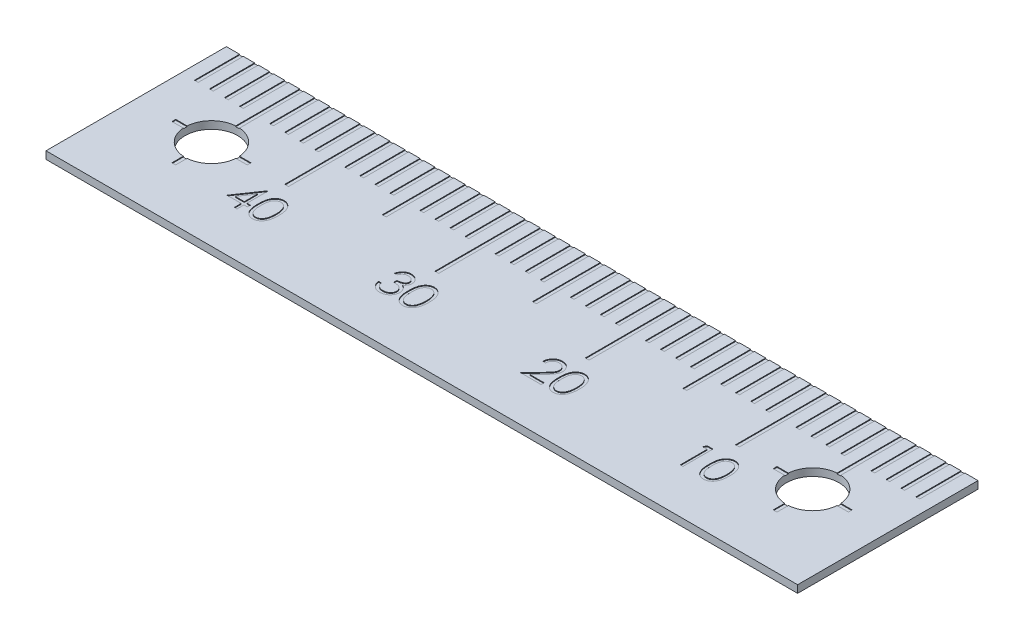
from build123d import *

# Parameters (mm, degrees)
SKETCH1_W           = 50
SKETCH1_H           = 12
BOSS_EXTRUDE1_DEPTH = 0.5
SKETCH2_W           = 0.25
SKETCH2_H           = 3
CUT_EXTRUDE2_DEPTH  = 0.05
LPATTERN2_COUNT     = 49
LPATTERN2_PITCH     = 1
SKETCH3_W           = 0.25
SKETCH3_H           = 3
CUT_EXTRUDE3_DEPTH  = 0.05
LPATTERN3_COUNT     = 4
LPATTERN3_PITCH     = 10
SKETCH4_W           = 0.25
SKETCH4_H           = 1.5
CUT_EXTRUDE4_DEPTH  = 0.05
LPATTERN4_COUNT     = 4
LPATTERN4_PITCH     = 10
LPATTERN4_COL_COUNT = 2
LPATTERN4_COL_PITCH = 10
CUT_EXTRUDE6_DEPTH  = 0.05
LPATTERN5_COUNT     = 2
LPATTERN5_PITCH     = 40
CUT_EXTRUDE12_DEPTH = 0.05
SKETCH20_R          = 1.75
CUT_EXTRUDE15_DEPTH = 0.5
LPATTERN6_COUNT     = 2
LPATTERN6_PITCH     = 40


with BuildPart() as part:
    # Sketch1 → Boss-Extrude1 (new body)
    with BuildSketch(Plane(origin=(0, 0, 0), x_dir=(1, 0, 0), z_dir=(0, 1, 0))):
        Rectangle(SKETCH1_W, SKETCH1_H)
    extrude(amount=-BOSS_EXTRUDE1_DEPTH)

    # Sketch2 → Cut-Extrude2 (cut)
    with BuildSketch(Plane(origin=(0, 0, 0), x_dir=(1, 0, 0), z_dir=(0, 1, 0))):
        with Locations((-24, 4.5)):
            Rectangle(SKETCH2_W, SKETCH2_H)
    cut_extrude2 = extrude(amount=-CUT_EXTRUDE2_DEPTH, mode=Mode.SUBTRACT)

    # LPattern2: Cut-Extrude2 ×49
    with Locations(*[(i * LPATTERN2_PITCH, 0, 0) for i in range(1, LPATTERN2_COUNT)]):
        add(cut_extrude2, mode=Mode.SUBTRACT)

    # Sketch3 → Cut-Extrude3 (cut)
    with BuildSketch(Plane(origin=(0, 0, 0), x_dir=(1, 0, 0), z_dir=(0, 1, 0))):
        with Locations((-15, 1.5)):
            Rectangle(SKETCH3_W, SKETCH3_H)
    cut_extrude3 = extrude(amount=-CUT_EXTRUDE3_DEPTH, mode=Mode.SUBTRACT)

    # LPattern3: Cut-Extrude3 ×4
    with Locations(*[(i * LPATTERN3_PITCH, 0, 0) for i in range(1, LPATTERN3_COUNT)]):
        add(cut_extrude3, mode=Mode.SUBTRACT)

    # Sketch4 → Cut-Extrude4 (cut)
    with BuildSketch(Plane(origin=(0, 0, 0), x_dir=(1, 0, 0), z_dir=(0, 1, 0))):
        with Locations((-10, 2.25)):
            Rectangle(SKETCH4_W, SKETCH4_H)
    cut_extrude4 = extrude(amount=-CUT_EXTRUDE4_DEPTH, mode=Mode.SUBTRACT)

    # LPattern4: Cut-Extrude4 ×4
    with Locations(*[(i * LPATTERN4_PITCH, 0, 0) for i in range(1, LPATTERN4_COUNT)]):
        add(cut_extrude4, mode=Mode.SUBTRACT)

    # LPattern4 col: Cut-Extrude4 ×2
    with Locations(*[(-i * LPATTERN4_COL_PITCH, 0, 0) for i in range(1, LPATTERN4_COL_COUNT)]):
        add(cut_extrude4, mode=Mode.SUBTRACT)

    # Sketch5 → Cut-Extrude6 (cut)
    with BuildSketch(Plane(origin=(0, 0, 0), x_dir=(1, 0, 0), z_dir=(0, 1, 0))):
        with BuildLine():
            Line((-20.12, 2.5), (-19.87, 2.5))
            Line((-19.87, 2.5), (-19.87, 1.74553))
            ThreePointArc((-19.87, 1.74553), (-18.757563, 1.237437), (-18.24947, 0.125))
            Line((-18.24947, 0.125), (-17.495, 0.125))
            Line((-17.495, 0.125), (-17.495, -0.125))
            Line((-17.495, -0.125), (-18.24947, -0.125))
            ThreePointArc((-18.24947, -0.125), (-18.757563, -1.237437), (-19.87, -1.74553))
            Line((-19.87, -1.74553), (-19.87, -2.5))
            Line((-19.87, -2.5), (-20.12, -2.5))
            Line((-20.12, -2.5), (-20.12, -1.74553))
            ThreePointArc((-20.12, -1.74553), (-21.232437, -1.237437), (-21.74053, -0.125))
            Line((-21.74053, -0.125), (-22.495, -0.125))
            Line((-22.495, -0.125), (-22.495, 0.125))
            Line((-22.495, 0.125), (-21.74053, 0.125))
            ThreePointArc((-21.74053, 0.125), (-21.232437, 1.237437), (-20.12, 1.74553))
            Line((-20.12, 1.74553), (-20.12, 2.5))
        make_face()
        with BuildLine():
            Line((-20.12, 1.494783), (-20.12, 0.125))
            Line((-20.12, 0.125), (-21.489783, 0.125))
            ThreePointArc((-21.489783, 0.125), (-21.05566, 1.06066), (-20.12, 1.494783))
        make_face(mode=Mode.SUBTRACT)
        with BuildLine():
            Line((-19.87, 1.494783), (-19.87, 0.125))
            Line((-19.87, 0.125), (-18.500217, 0.125))
            ThreePointArc((-18.500217, 0.125), (-18.93434, 1.06066), (-19.87, 1.494783))
        make_face(mode=Mode.SUBTRACT)
        with BuildLine():
            Line((-21.489783, -0.125), (-20.12, -0.125))
            Line((-20.12, -0.125), (-20.12, -1.494783))
            ThreePointArc((-20.12, -1.494783), (-21.05566, -1.06066), (-21.489783, -0.125))
        make_face(mode=Mode.SUBTRACT)
        with BuildLine():
            Line((-19.87, -0.125), (-19.87, -1.494783))
            ThreePointArc((-19.87, -1.494783), (-18.93434, -1.06066), (-18.500217, -0.125))
            Line((-18.500217, -0.125), (-19.87, -0.125))
        make_face(mode=Mode.SUBTRACT)
    cut_extrude6 = extrude(amount=-CUT_EXTRUDE6_DEPTH, mode=Mode.SUBTRACT)

    # LPattern5: Cut-Extrude6 ×2
    with Locations(*[(i * LPATTERN5_PITCH, 0, 0) for i in range(1, LPATTERN5_COUNT)]):
        add(cut_extrude6, mode=Mode.SUBTRACT)

    # Sketch15 → Cut-Extrude12 (cut)
    # profile 1 of 8: a face of its own
    with BuildSketch(Plane(origin=(0, 0, 0), x_dir=(1, 0, 0), z_dir=(0, 1, 0))):
        Polygon((-15.33133, -0.948718), (-15.294872, -0.948718), (-15.294872, -2.333333), (-15.064103, -2.333333), (-15.064103, -2.538462), (-15.294872, -2.538462), (-15.294872, -3), (-15.474359, -3), (-15.474359, -2.538462), (-16.423077, -2.538462), align=None)
        Polygon((-15.474359, -2.333333), (-15.474359, -1.464744), (-16.070513, -2.333333), align=None, mode=Mode.SUBTRACT)
    # profile 2 of 8: a face of its own
    with BuildSketch(Plane(origin=(0, 0, 0), x_dir=(1, 0, 0), z_dir=(0, 1, 0))):
        with BuildLine():
            add(Edge.make_bspline(
                [(-14.884615, -2.000801), (-14.884428, -1.968746), (-14.884064, -1.906477), (-14.880013, -1.815743), (-14.873285, -1.730623), (-14.864063, -1.651112), (-14.852841, -1.577191), (-14.837861, -1.509057), (-14.820825, -1.446395), (-14.801081, -1.388999), (-14.778802, -1.336098), (-14.754554, -1.286712), (-14.727374, -1.240916), (-14.698816, -1.197981), (-14.667723, -1.158607), (-14.634981, -1.12224), (-14.599312, -1.089719), (-14.561927, -1.060093), (-14.522489, -1.034122), (-14.482122, -1.011246), (-14.440548, -0.991703), (-14.397653, -0.976337), (-14.353823, -0.963645), (-14.308904, -0.954966), (-14.262823, -0.949505), (-14.23172, -0.948983), (-14.215946, -0.948718)],
                knots=[0, 0, 0, 0, 1.646271, 3.197905, 4.663502, 6.030701, 7.308323, 8.501638, 9.611534, 10.641858, 11.616357, 12.558055, 13.465017, 14.349606, 15.204444, 16.039544, 16.859896, 17.680448, 18.487036, 19.282494, 20.061911, 20.843046, 21.620317, 22.403197, 23.190182, 24, 24, 24, 24], degree=3))
            add(Edge.make_bspline(
                [(-14.215946, -0.948718), (-14.20004, -0.948997), (-14.168408, -0.949551), (-14.121642, -0.954879), (-14.075956, -0.96372), (-14.031546, -0.976246), (-13.988046, -0.991786), (-13.945796, -1.011265), (-13.904535, -1.033938), (-13.864918, -1.060581), (-13.826509, -1.090285), (-13.790253, -1.123863), (-13.756147, -1.160977), (-13.723761, -1.20123), (-13.694015, -1.245393), (-13.665687, -1.292698), (-13.640332, -1.343973), (-13.615912, -1.398362), (-13.594833, -1.45737), (-13.575824, -1.520664), (-13.560465, -1.588992), (-13.547671, -1.661995), (-13.537759, -1.739942), (-13.530541, -1.822666), (-13.526728, -1.910221), (-13.52601, -1.970082), (-13.525641, -2.000801)],
                knots=[0, 0, 0, 0, 0.810915, 1.612654, 2.396698, 3.181599, 3.963628, 4.749916, 5.551656, 6.361999, 7.182127, 8.025566, 8.878628, 9.750805, 10.657532, 11.591945, 12.560507, 13.572878, 14.63071, 15.753379, 16.941252, 18.199788, 19.531963, 20.947069, 22.433334, 24, 24, 24, 24], degree=3))
            add(Edge.make_bspline(
                [(-13.525641, -2.000801), (-13.526013, -2.031386), (-13.526739, -2.09098), (-13.530498, -2.178141), (-13.537903, -2.260425), (-13.547166, -2.338031), (-13.559995, -2.410636), (-13.575769, -2.47849), (-13.593284, -2.541886), (-13.614904, -2.600306), (-13.638567, -2.654564), (-13.664313, -2.705231), (-13.691896, -2.752755), (-13.721946, -2.796755), (-13.753977, -2.837542), (-13.788673, -2.874398), (-13.825056, -2.90821), (-13.863577, -2.938297), (-13.903812, -2.964631), (-13.944932, -2.988182), (-13.987665, -3.007172), (-14.031044, -3.023477), (-14.075689, -3.035935), (-14.121544, -3.044549), (-14.168376, -3.05059), (-14.200034, -3.05105), (-14.215946, -3.051282)],
                knots=[0, 0, 0, 0, 1.561519, 3.042556, 4.452378, 5.778352, 7.031515, 8.214009, 9.334063, 10.386616, 11.391082, 12.354593, 13.286541, 14.194234, 15.072675, 15.931287, 16.775624, 17.606196, 18.423083, 19.229, 20.022332, 20.807537, 21.593274, 22.384846, 23.188221, 24, 24, 24, 24], degree=3))
            add(Edge.make_bspline(
                [(-14.215946, -3.051282), (-14.231719, -3.051016), (-14.262822, -3.05049), (-14.308909, -3.045054), (-14.353642, -3.036313), (-14.397241, -3.024075), (-14.439931, -3.009095), (-14.481129, -2.989579), (-14.521293, -2.967102), (-14.560317, -2.941505), (-14.597467, -2.912178), (-14.632951, -2.879742), (-14.66588, -2.843385), (-14.696528, -2.803684), (-14.725656, -2.761002), (-14.75245, -2.714757), (-14.777233, -2.665133), (-14.799887, -2.611808), (-14.819972, -2.554005), (-14.837713, -2.491063), (-14.851721, -2.422426), (-14.863712, -2.348644), (-14.873383, -2.269402), (-14.879985, -2.184656), (-14.884066, -2.094458), (-14.884429, -2.03259), (-14.884615, -2.000801)],
                knots=[0, 0, 0, 0, 0.810892, 1.59892, 2.382837, 3.152668, 3.926045, 4.706494, 5.493654, 6.291793, 7.103789, 7.925228, 8.761436, 9.622818, 10.502889, 11.416981, 12.369137, 13.353925, 14.394356, 15.51418, 16.714355, 17.994756, 19.357759, 20.818453, 22.365282, 24, 24, 24, 24], degree=3))
        make_face()
        with BuildLine():
            add(Edge.make_bspline(
                [(-14.705128, -2), (-14.70506, -2.026714), (-14.704927, -2.078559), (-14.701467, -2.153898), (-14.696752, -2.224167), (-14.690672, -2.289455), (-14.681641, -2.349541), (-14.671523, -2.404837), (-14.65921, -2.455053), (-14.644641, -2.500532), (-14.628048, -2.542046), (-14.60993, -2.580675), (-14.590467, -2.616876), (-14.568684, -2.650324), (-14.544961, -2.681127), (-14.519834, -2.709832), (-14.492364, -2.73543), (-14.454362, -2.766131), (-14.404192, -2.797856), (-14.340981, -2.825483), (-14.276027, -2.842844), (-14.231941, -2.845052), (-14.209936, -2.846154)],
                knots=[0, 0, 0, 0, 1.459021, 2.831674, 4.118529, 5.306027, 6.411945, 7.43633, 8.375795, 9.233975, 10.042672, 10.816086, 11.563611, 12.285937, 12.993565, 13.685989, 14.367179, 15.041617, 16.353049, 17.594442, 18.799311, 20, 20, 20, 20], degree=3))
            add(Edge.make_bspline(
                [(-14.209936, -2.846154), (-14.187789, -2.845241), (-14.14354, -2.843417), (-14.078892, -2.825817), (-14.016132, -2.799263), (-13.966948, -2.767865), (-13.929529, -2.737963), (-13.90272, -2.712469), (-13.878113, -2.683923), (-13.854774, -2.653123), (-13.833369, -2.619482), (-13.813905, -2.58316), (-13.796143, -2.544058), (-13.786023, -2.516761), (-13.780849, -2.502804)],
                knots=[0, 0, 0, 0, 1.353761, 2.704727, 4.075138, 5.516105, 6.260822, 7.00711, 7.77809, 8.566572, 9.372053, 10.217411, 11.088608, 12, 12, 12, 12], degree=3))
            add(Edge.make_bspline(
                [(-13.780849, -2.502804), (-13.77482, -2.484959), (-13.762577, -2.448725), (-13.746799, -2.392517), (-13.734373, -2.333544), (-13.723194, -2.272158), (-13.715564, -2.207907), (-13.709422, -2.140989), (-13.705805, -2.071354), (-13.705356, -2.024043), (-13.705128, -2)],
                knots=[0, 0, 0, 0, 0.884707, 1.796334, 2.740028, 3.714593, 4.726048, 5.77782, 6.870743, 8, 8, 8, 8], degree=3))
            add(Edge.make_bspline(
                [(-13.705128, -2), (-13.705443, -1.975961), (-13.706058, -1.928937), (-13.708408, -1.860069), (-13.714479, -1.794659), (-13.721221, -1.732424), (-13.731163, -1.67371), (-13.741881, -1.618024), (-13.756282, -1.566057), (-13.771665, -1.516994), (-13.789271, -1.471394), (-13.808651, -1.429043), (-13.829349, -1.389737), (-13.851831, -1.353585), (-13.875828, -1.320423), (-13.901975, -1.290918), (-13.929235, -1.264154), (-13.967416, -1.233604), (-14.017402, -1.202454), (-14.079599, -1.173788), (-14.144325, -1.157326), (-14.188081, -1.155005), (-14.209936, -1.153846)],
                knots=[0, 0, 0, 0, 1.313624, 2.569729, 3.763503, 4.902123, 5.988968, 7.016459, 7.998834, 8.933435, 9.825091, 10.667527, 11.477055, 12.250526, 12.991943, 13.710641, 14.402116, 15.076753, 16.378508, 17.609869, 18.806227, 20, 20, 20, 20], degree=3))
            add(Edge.make_bspline(
                [(-14.209936, -1.153846), (-14.232056, -1.155007), (-14.276337, -1.157331), (-14.341736, -1.173727), (-14.404424, -1.202306), (-14.454277, -1.233707), (-14.492485, -1.263615), (-14.51939, -1.28955), (-14.544616, -1.317919), (-14.567855, -1.349006), (-14.58962, -1.382415), (-14.609609, -1.418408), (-14.627619, -1.457169), (-14.644239, -1.498664), (-14.658852, -1.544139), (-14.670906, -1.594293), (-14.682041, -1.649414), (-14.689924, -1.709825), (-14.696932, -1.775129), (-14.701435, -1.845573), (-14.704939, -1.921039), (-14.705064, -1.973152), (-14.705128, -2)],
                knots=[0, 0, 0, 0, 1.207732, 2.417665, 3.655092, 4.956221, 5.625982, 6.301752, 6.994048, 7.697132, 8.419324, 9.170224, 9.943494, 10.752041, 11.61006, 12.549351, 13.567764, 14.679664, 15.874934, 17.154273, 18.533957, 20, 20, 20, 20], degree=3))
        make_face(mode=Mode.SUBTRACT)
    # profile 3 of 8: a face of its own
    with BuildSketch(Plane(origin=(0, 0, 0), x_dir=(1, 0, 0), z_dir=(0, 1, 0))):
        with BuildLine():
            Line((-6.166667, -1.461538), (-6.346154, -1.461538))
            add(Edge.make_bspline(
                [(-6.346154, -1.461538), (-6.341291, -1.441406), (-6.331785, -1.402048), (-6.311958, -1.345815), (-6.290359, -1.292601), (-6.264422, -1.243404), (-6.236131, -1.197233), (-6.203718, -1.155136), (-6.168678, -1.116043), (-6.129921, -1.08135), (-6.089276, -1.049934), (-6.046171, -1.023148), (-6.001472, -1.000106), (-5.95487, -0.981123), (-5.906227, -0.966823), (-5.855981, -0.956447), (-5.804002, -0.949709), (-5.768718, -0.949052), (-5.750801, -0.948718)],
                knots=[0, 0, 0, 0, 1.162006, 2.271626, 3.343759, 4.38331, 5.39023, 6.379919, 7.361854, 8.333199, 9.295911, 10.242431, 11.177959, 12.116337, 13.062827, 14.020065, 14.994645, 16, 16, 16, 16], degree=3))
            add(Edge.make_bspline(
                [(-5.750801, -0.948718), (-5.724697, -0.949506), (-5.673057, -0.951065), (-5.597193, -0.965302), (-5.524035, -0.987831), (-5.454384, -1.018958), (-5.389687, -1.057351), (-5.332124, -1.103045), (-5.282473, -1.155159), (-5.240819, -1.212721), (-5.208205, -1.274238), (-5.184156, -1.337553), (-5.169515, -1.402514), (-5.167617, -1.446375), (-5.166667, -1.468349)],
                knots=[0, 0, 0, 0, 1.083051, 2.142477, 3.193116, 4.255572, 5.302634, 6.308963, 7.297364, 8.282367, 9.249858, 10.179914, 11.088141, 12, 12, 12, 12], degree=3))
            add(Edge.make_bspline(
                [(-5.166667, -1.468349), (-5.167332, -1.489496), (-5.168633, -1.530877), (-5.179681, -1.591289), (-5.198273, -1.648227), (-5.224027, -1.701931), (-5.257365, -1.752059), (-5.297749, -1.798726), (-5.345465, -1.842137), (-5.381624, -1.867005), (-5.40024, -1.879808)],
                knots=[0, 0, 0, 0, 1.02454, 2.004867, 2.965041, 3.920578, 4.882998, 5.874505, 6.905732, 8, 8, 8, 8], degree=3))
            add(Edge.make_bspline(
                [(-5.40024, -1.879808), (-5.378965, -1.890081), (-5.336813, -1.910435), (-5.279355, -1.950353), (-5.227196, -1.996442), (-5.198109, -2.032409), (-5.183494, -2.050481)],
                knots=[0, 0, 0, 0, 1.015518, 2.012036, 3.001164, 4, 4, 4, 4], degree=3))
            add(Edge.make_bspline(
                [(-5.183494, -2.050481), (-5.17387, -2.063657), (-5.15478, -2.089793), (-5.131217, -2.131813), (-5.109841, -2.1743), (-5.093183, -2.218391), (-5.080284, -2.263576), (-5.071063, -2.309931), (-5.065335, -2.357496), (-5.064515, -2.389674), (-5.064103, -2.405849)],
                knots=[0, 0, 0, 0, 1.025084, 2.033382, 3.024893, 4.013698, 4.99189, 5.976765, 6.982997, 8, 8, 8, 8], degree=3))
            add(Edge.make_bspline(
                [(-5.064103, -2.405849), (-5.065128, -2.433855), (-5.067174, -2.489734), (-5.085462, -2.572291), (-5.113813, -2.652992), (-5.154074, -2.730177), (-5.203141, -2.802394), (-5.261516, -2.86701), (-5.328537, -2.922552), (-5.403283, -2.968957), (-5.484264, -3.006053), (-5.570879, -3.0318), (-5.661879, -3.04857), (-5.724283, -3.050368), (-5.75601, -3.051282)],
                knots=[0, 0, 0, 0, 0.955779, 1.90706, 2.875434, 3.871313, 4.872416, 5.851225, 6.836216, 7.836434, 8.849229, 9.869734, 10.916972, 12, 12, 12, 12], degree=3))
            add(Edge.make_bspline(
                [(-5.75601, -3.051282), (-5.777392, -3.050786), (-5.819466, -3.04981), (-5.881319, -3.043136), (-5.94036, -3.030948), (-5.996668, -3.014546), (-6.050294, -2.99375), (-6.101074, -2.967854), (-6.149319, -2.93739), (-6.194576, -2.902), (-6.236838, -2.86241), (-6.274982, -2.81792), (-6.309645, -2.76935), (-6.339898, -2.716136), (-6.367119, -2.658968), (-6.389508, -2.597111), (-6.409214, -2.531121), (-6.418376, -2.485133), (-6.423077, -2.461538)],
                knots=[0, 0, 0, 0, 1.048659, 2.063411, 3.046034, 4.001478, 4.936775, 5.862367, 6.792675, 7.73072, 8.675894, 9.62783, 10.600096, 11.597688, 12.626045, 13.701542, 14.820724, 16, 16, 16, 16], degree=3))
            Line((-6.423077, -2.461538), (-6.24359, -2.461538))
            add(Edge.make_bspline(
                [(-6.24359, -2.461538), (-6.238914, -2.476938), (-6.229818, -2.506891), (-6.214336, -2.55), (-6.196697, -2.589519), (-6.177774, -2.625738), (-6.157901, -2.659013), (-6.135663, -2.688466), (-6.11271, -2.715389), (-6.095407, -2.730557), (-6.086939, -2.737981)],
                knots=[0, 0, 0, 0, 1.198163, 2.330531, 3.407731, 4.417277, 5.372219, 6.288973, 7.162601, 8, 8, 8, 8], degree=3))
            add(Edge.make_bspline(
                [(-6.086939, -2.737981), (-6.075741, -2.746614), (-6.05338, -2.763854), (-6.016941, -2.785855), (-5.978618, -2.804918), (-5.937581, -2.819481), (-5.894715, -2.831811), (-5.849328, -2.83988), (-5.80182, -2.845416), (-5.769381, -2.845904), (-5.752804, -2.846154)],
                knots=[0, 0, 0, 0, 0.94617, 1.88942, 2.845303, 3.807233, 4.801019, 5.828865, 6.890508, 8, 8, 8, 8], degree=3))
            add(Edge.make_bspline(
                [(-5.752804, -2.846154), (-5.734088, -2.845802), (-5.69749, -2.845114), (-5.644087, -2.838785), (-5.593283, -2.829567), (-5.545641, -2.815331), (-5.500538, -2.797742), (-5.458606, -2.775657), (-5.419294, -2.749746), (-5.383106, -2.720295), (-5.350565, -2.688054), (-5.321914, -2.654333), (-5.297557, -2.619272), (-5.277909, -2.582679), (-5.262395, -2.544705), (-5.251833, -2.505242), (-5.244489, -2.464615), (-5.243891, -2.436999), (-5.24359, -2.423077)],
                knots=[0, 0, 0, 0, 1.217148, 2.380027, 3.494445, 4.572153, 5.609568, 6.639425, 7.649109, 8.668171, 9.669598, 10.6252, 11.543418, 12.441394, 13.322311, 14.205496, 15.095365, 16, 16, 16, 16], degree=3))
            add(Edge.make_bspline(
                [(-5.24359, -2.423077), (-5.244464, -2.404442), (-5.246209, -2.367264), (-5.259528, -2.312569), (-5.281436, -2.25987), (-5.312106, -2.210066), (-5.349441, -2.163909), (-5.393078, -2.122725), (-5.44338, -2.088742), (-5.489677, -2.065263), (-5.530685, -2.049242), (-5.56578, -2.03857), (-5.605069, -2.029534), (-5.648079, -2.021127), (-5.695132, -2.013972), (-5.746178, -2.008005), (-5.801227, -2.003231), (-5.839336, -2.001099), (-5.858974, -2)],
                knots=[0, 0, 0, 0, 1.070547, 2.135767, 3.216562, 4.339749, 5.48608, 6.621378, 7.775626, 8.963673, 9.598147, 10.304877, 11.070271, 11.915, 12.823868, 13.805723, 14.869254, 16, 16, 16, 16], degree=3))
            Line((-5.858974, -2), (-5.858974, -1.794872))
            add(Edge.make_bspline(
                [(-5.858974, -1.794872), (-5.834231, -1.794452), (-5.785764, -1.793629), (-5.714968, -1.783682), (-5.647269, -1.769922), (-5.584168, -1.748844), (-5.526654, -1.724364), (-5.476757, -1.695877), (-5.435176, -1.664212), (-5.402112, -1.628879), (-5.377239, -1.590984), (-5.359052, -1.551489), (-5.348309, -1.510047), (-5.346875, -1.481764), (-5.346154, -1.467548)],
                knots=[0, 0, 0, 0, 1.321987, 2.589447, 3.816329, 5.010887, 6.139806, 7.153945, 8.075214, 8.924035, 9.728124, 10.488708, 11.240356, 12, 12, 12, 12], degree=3))
            add(Edge.make_bspline(
                [(-5.346154, -1.467548), (-5.346391, -1.457104), (-5.346862, -1.436325), (-5.352803, -1.405968), (-5.361731, -1.376539), (-5.374005, -1.348163), (-5.390434, -1.321037), (-5.410094, -1.29493), (-5.433505, -1.26999), (-5.460331, -1.246745), (-5.489138, -1.224591), (-5.520709, -1.205783), (-5.554093, -1.1897), (-5.589326, -1.176437), (-5.626524, -1.166461), (-5.66551, -1.159297), (-5.70636, -1.154819), (-5.73423, -1.154174), (-5.748397, -1.153846)],
                knots=[0, 0, 0, 0, 0.884393, 1.759458, 2.611959, 3.489219, 4.372814, 5.294549, 6.255912, 7.266815, 8.301785, 9.332969, 10.376267, 11.440494, 12.520033, 13.637163, 14.798856, 16, 16, 16, 16], degree=3))
            add(Edge.make_bspline(
                [(-5.748397, -1.153846), (-5.77117, -1.154641), (-5.81565, -1.156194), (-5.879772, -1.169796), (-5.939383, -1.191498), (-5.984948, -1.217402), (-6.018596, -1.242974), (-6.04264, -1.265307), (-6.066251, -1.290125), (-6.087877, -1.318959), (-6.109748, -1.349854), (-6.129659, -1.384382), (-6.149008, -1.421642), (-6.160666, -1.447982), (-6.166667, -1.461538)],
                knots=[0, 0, 0, 0, 1.472543, 2.87622, 4.22179, 5.565194, 6.249814, 6.953379, 7.68725, 8.46357, 9.283607, 10.136033, 11.040678, 12, 12, 12, 12], degree=3))
        make_face()
    # profile 4 of 8: a face of its own
    with BuildSketch(Plane(origin=(0, 0, 0), x_dir=(1, 0, 0), z_dir=(0, 1, 0))):
        with BuildLine():
            add(Edge.make_bspline(
                [(-4.884615, -2.000801), (-4.884428, -1.968746), (-4.884064, -1.906477), (-4.880013, -1.815743), (-4.873285, -1.730623), (-4.864063, -1.651112), (-4.852841, -1.577191), (-4.837861, -1.509057), (-4.820825, -1.446395), (-4.801081, -1.388999), (-4.778802, -1.336098), (-4.754554, -1.286712), (-4.727374, -1.240916), (-4.698816, -1.197981), (-4.667723, -1.158607), (-4.634981, -1.12224), (-4.599312, -1.089719), (-4.561927, -1.060093), (-4.522489, -1.034122), (-4.482122, -1.011246), (-4.440548, -0.991703), (-4.397653, -0.976337), (-4.353823, -0.963645), (-4.308904, -0.954966), (-4.262823, -0.949505), (-4.23172, -0.948983), (-4.215946, -0.948718)],
                knots=[0, 0, 0, 0, 1.646271, 3.197905, 4.663502, 6.030701, 7.308323, 8.501638, 9.611534, 10.641858, 11.616357, 12.558055, 13.465017, 14.349606, 15.204444, 16.039544, 16.859896, 17.680448, 18.487036, 19.282494, 20.061911, 20.843046, 21.620317, 22.403197, 23.190182, 24, 24, 24, 24], degree=3))
            add(Edge.make_bspline(
                [(-4.215946, -0.948718), (-4.20004, -0.948997), (-4.168408, -0.949551), (-4.121642, -0.954879), (-4.075956, -0.96372), (-4.031546, -0.976246), (-3.988046, -0.991786), (-3.945796, -1.011265), (-3.904535, -1.033938), (-3.864918, -1.060581), (-3.826509, -1.090285), (-3.790253, -1.123863), (-3.756147, -1.160977), (-3.723761, -1.20123), (-3.694015, -1.245393), (-3.665687, -1.292698), (-3.640332, -1.343973), (-3.615912, -1.398362), (-3.594833, -1.45737), (-3.575824, -1.520664), (-3.560465, -1.588992), (-3.547671, -1.661995), (-3.537759, -1.739942), (-3.530541, -1.822666), (-3.526728, -1.910221), (-3.52601, -1.970082), (-3.525641, -2.000801)],
                knots=[0, 0, 0, 0, 0.810915, 1.612654, 2.396698, 3.181599, 3.963628, 4.749916, 5.551656, 6.361999, 7.182127, 8.025566, 8.878628, 9.750805, 10.657532, 11.591945, 12.560507, 13.572878, 14.63071, 15.753379, 16.941252, 18.199788, 19.531963, 20.947069, 22.433334, 24, 24, 24, 24], degree=3))
            add(Edge.make_bspline(
                [(-3.525641, -2.000801), (-3.526013, -2.031386), (-3.526739, -2.09098), (-3.530498, -2.178141), (-3.537903, -2.260425), (-3.547166, -2.338031), (-3.559995, -2.410636), (-3.575769, -2.47849), (-3.593284, -2.541886), (-3.614904, -2.600306), (-3.638567, -2.654564), (-3.664313, -2.705231), (-3.691896, -2.752755), (-3.721946, -2.796755), (-3.753977, -2.837542), (-3.788673, -2.874398), (-3.825056, -2.90821), (-3.863577, -2.938297), (-3.903812, -2.964631), (-3.944932, -2.988182), (-3.987665, -3.007172), (-4.031044, -3.023477), (-4.075689, -3.035935), (-4.121544, -3.044549), (-4.168376, -3.05059), (-4.200034, -3.05105), (-4.215946, -3.051282)],
                knots=[0, 0, 0, 0, 1.561519, 3.042556, 4.452378, 5.778352, 7.031515, 8.214009, 9.334063, 10.386616, 11.391082, 12.354593, 13.286541, 14.194234, 15.072675, 15.931287, 16.775624, 17.606196, 18.423083, 19.229, 20.022332, 20.807537, 21.593274, 22.384846, 23.188221, 24, 24, 24, 24], degree=3))
            add(Edge.make_bspline(
                [(-4.215946, -3.051282), (-4.231719, -3.051016), (-4.262822, -3.05049), (-4.308909, -3.045054), (-4.353642, -3.036313), (-4.397241, -3.024075), (-4.439931, -3.009095), (-4.481129, -2.989579), (-4.521293, -2.967102), (-4.560317, -2.941505), (-4.597467, -2.912178), (-4.632951, -2.879742), (-4.66588, -2.843385), (-4.696528, -2.803684), (-4.725656, -2.761002), (-4.75245, -2.714757), (-4.777233, -2.665133), (-4.799887, -2.611808), (-4.819972, -2.554005), (-4.837713, -2.491063), (-4.851721, -2.422426), (-4.863712, -2.348644), (-4.873383, -2.269402), (-4.879985, -2.184656), (-4.884066, -2.094458), (-4.884429, -2.03259), (-4.884615, -2.000801)],
                knots=[0, 0, 0, 0, 0.810892, 1.59892, 2.382837, 3.152668, 3.926045, 4.706494, 5.493654, 6.291793, 7.103789, 7.925228, 8.761436, 9.622818, 10.502889, 11.416981, 12.369137, 13.353925, 14.394356, 15.51418, 16.714355, 17.994756, 19.357759, 20.818453, 22.365282, 24, 24, 24, 24], degree=3))
        make_face()
        with BuildLine():
            add(Edge.make_bspline(
                [(-4.705128, -2), (-4.70506, -2.026714), (-4.704927, -2.078559), (-4.701467, -2.153898), (-4.696752, -2.224167), (-4.690672, -2.289455), (-4.681641, -2.349541), (-4.671523, -2.404837), (-4.65921, -2.455053), (-4.644641, -2.500532), (-4.628048, -2.542046), (-4.60993, -2.580675), (-4.590467, -2.616876), (-4.568684, -2.650324), (-4.544961, -2.681127), (-4.519834, -2.709832), (-4.492364, -2.73543), (-4.454362, -2.766131), (-4.404192, -2.797856), (-4.340981, -2.825483), (-4.276027, -2.842844), (-4.231941, -2.845052), (-4.209936, -2.846154)],
                knots=[0, 0, 0, 0, 1.459021, 2.831674, 4.118529, 5.306027, 6.411945, 7.43633, 8.375795, 9.233975, 10.042672, 10.816086, 11.563611, 12.285937, 12.993565, 13.685989, 14.367179, 15.041617, 16.353049, 17.594442, 18.799311, 20, 20, 20, 20], degree=3))
            add(Edge.make_bspline(
                [(-4.209936, -2.846154), (-4.187789, -2.845241), (-4.14354, -2.843417), (-4.078892, -2.825817), (-4.016132, -2.799263), (-3.966948, -2.767865), (-3.929529, -2.737963), (-3.90272, -2.712469), (-3.878113, -2.683923), (-3.854774, -2.653123), (-3.833369, -2.619482), (-3.813905, -2.58316), (-3.796143, -2.544058), (-3.786023, -2.516761), (-3.780849, -2.502804)],
                knots=[0, 0, 0, 0, 1.353761, 2.704727, 4.075138, 5.516105, 6.260822, 7.00711, 7.77809, 8.566572, 9.372053, 10.217411, 11.088608, 12, 12, 12, 12], degree=3))
            add(Edge.make_bspline(
                [(-3.780849, -2.502804), (-3.77482, -2.484959), (-3.762577, -2.448725), (-3.746799, -2.392517), (-3.734373, -2.333544), (-3.723194, -2.272158), (-3.715564, -2.207907), (-3.709422, -2.140989), (-3.705805, -2.071354), (-3.705356, -2.024043), (-3.705128, -2)],
                knots=[0, 0, 0, 0, 0.884707, 1.796334, 2.740028, 3.714593, 4.726048, 5.77782, 6.870743, 8, 8, 8, 8], degree=3))
            add(Edge.make_bspline(
                [(-3.705128, -2), (-3.705443, -1.975961), (-3.706058, -1.928937), (-3.708408, -1.860069), (-3.714479, -1.794659), (-3.721221, -1.732424), (-3.731163, -1.67371), (-3.741881, -1.618024), (-3.756282, -1.566057), (-3.771665, -1.516994), (-3.789271, -1.471394), (-3.808651, -1.429043), (-3.829349, -1.389737), (-3.851831, -1.353585), (-3.875828, -1.320423), (-3.901975, -1.290918), (-3.929235, -1.264154), (-3.967416, -1.233604), (-4.017402, -1.202454), (-4.079599, -1.173788), (-4.144325, -1.157326), (-4.188081, -1.155005), (-4.209936, -1.153846)],
                knots=[0, 0, 0, 0, 1.313624, 2.569729, 3.763503, 4.902123, 5.988968, 7.016459, 7.998834, 8.933435, 9.825091, 10.667527, 11.477055, 12.250526, 12.991943, 13.710641, 14.402116, 15.076753, 16.378508, 17.609869, 18.806227, 20, 20, 20, 20], degree=3))
            add(Edge.make_bspline(
                [(-4.209936, -1.153846), (-4.232056, -1.155007), (-4.276337, -1.157331), (-4.341736, -1.173727), (-4.404424, -1.202306), (-4.454277, -1.233707), (-4.492485, -1.263615), (-4.51939, -1.28955), (-4.544616, -1.317919), (-4.567855, -1.349006), (-4.58962, -1.382415), (-4.609609, -1.418408), (-4.627619, -1.457169), (-4.644239, -1.498664), (-4.658852, -1.544139), (-4.670906, -1.594293), (-4.682041, -1.649414), (-4.689924, -1.709825), (-4.696932, -1.775129), (-4.701435, -1.845573), (-4.704939, -1.921039), (-4.705064, -1.973152), (-4.705128, -2)],
                knots=[0, 0, 0, 0, 1.207732, 2.417665, 3.655092, 4.956221, 5.625982, 6.301752, 6.994048, 7.697132, 8.419324, 9.170224, 9.943494, 10.752041, 11.61006, 12.549351, 13.567764, 14.679664, 15.874934, 17.154273, 18.533957, 20, 20, 20, 20], degree=3))
        make_face(mode=Mode.SUBTRACT)
    # profile 5 of 8: a face of its own
    with BuildSketch(Plane(origin=(0, 0, 0), x_dir=(1, 0, 0), z_dir=(0, 1, 0))):
        with BuildLine():
            Line((3.833333, -1.615385), (3.653846, -1.615385))
            add(Edge.make_bspline(
                [(3.653846, -1.615385), (3.655016, -1.591573), (3.657313, -1.544807), (3.668072, -1.476622), (3.683467, -1.411447), (3.705234, -1.349807), (3.732266, -1.291157), (3.764683, -1.235728), (3.80308, -1.183733), (3.846626, -1.135654), (3.893923, -1.091547), (3.944955, -1.053458), (3.99858, -1.021276), (4.054637, -0.994373), (4.113757, -0.974179), (4.175405, -0.959195), (4.23985, -0.95018), (4.283759, -0.949211), (4.30609, -0.948718)],
                knots=[0, 0, 0, 0, 1.100653, 2.161653, 3.183659, 4.190469, 5.17592, 6.163126, 7.151508, 8.156236, 9.156009, 10.134483, 11.092019, 12.041331, 13.001268, 13.972401, 14.968799, 16, 16, 16, 16], degree=3))
            add(Edge.make_bspline(
                [(4.30609, -0.948718), (4.32802, -0.949231), (4.371112, -0.95024), (4.434005, -0.958904), (4.493878, -0.972473), (4.550614, -0.99151), (4.60376, -1.017101), (4.653716, -1.047842), (4.701076, -1.083397), (4.743709, -1.125256), (4.782856, -1.169943), (4.816629, -1.21765), (4.845551, -1.266924), (4.869658, -1.31814), (4.887404, -1.371781), (4.900878, -1.427065), (4.908493, -1.484565), (4.909662, -1.523483), (4.910256, -1.543269)],
                knots=[0, 0, 0, 0, 1.111607, 2.184269, 3.212621, 4.221275, 5.21176, 6.196651, 7.192148, 8.207485, 9.220403, 10.201282, 11.166442, 12.114753, 13.065576, 14.026451, 14.996634, 16, 16, 16, 16], degree=3))
            add(Edge.make_bspline(
                [(4.910256, -1.543269), (4.909289, -1.571125), (4.907371, -1.626348), (4.890962, -1.707499), (4.865336, -1.786124), (4.83448, -1.849403), (4.803353, -1.900393), (4.775303, -1.942375), (4.742466, -1.987579), (4.704364, -2.035851), (4.661785, -2.087572), (4.614344, -2.142709), (4.561702, -2.200693), (4.524754, -2.240296), (4.505609, -2.260817)],
                knots=[0, 0, 0, 0, 1.184426, 2.348068, 3.509069, 4.696111, 5.333549, 6.050745, 6.844228, 7.710549, 8.66745, 9.695053, 10.805634, 12, 12, 12, 12], degree=3))
            Line((4.505609, -2.260817), (4.005208, -2.794872))
            Line((4.005208, -2.794872), (4.935897, -2.794872))
            Line((4.935897, -2.794872), (4.935897, -3))
            Line((4.935897, -3), (3.576923, -3))
            Line((3.576923, -3), (4.352564, -2.172276))
            add(Edge.make_bspline(
                [(4.352564, -2.172276), (4.371449, -2.152562), (4.407722, -2.114697), (4.459026, -2.059415), (4.505106, -2.00813), (4.546258, -1.960938), (4.581592, -1.917148), (4.612947, -1.87818), (4.638071, -1.84232), (4.665337, -1.800754), (4.691745, -1.750004), (4.714437, -1.687985), (4.728274, -1.624141), (4.729934, -1.580997), (4.730769, -1.559295)],
                knots=[0, 0, 0, 0, 1.329632, 2.55395, 3.673216, 4.687768, 5.603094, 6.413772, 7.123043, 7.734684, 8.834405, 9.900288, 10.943827, 12, 12, 12, 12], degree=3))
            add(Edge.make_bspline(
                [(4.730769, -1.559295), (4.730406, -1.545648), (4.72969, -1.518754), (4.723371, -1.479322), (4.713822, -1.441285), (4.700139, -1.404526), (4.682078, -1.369414), (4.660094, -1.335907), (4.634728, -1.303513), (4.605384, -1.27314), (4.573149, -1.245322), (4.539095, -1.220679), (4.503067, -1.200086), (4.465215, -1.183204), (4.425646, -1.169961), (4.384284, -1.160784), (4.341241, -1.155023), (4.311851, -1.154243), (4.296875, -1.153846)],
                knots=[0, 0, 0, 0, 0.991446, 1.95395, 2.895816, 3.838931, 4.798493, 5.759822, 6.748412, 7.785213, 8.824557, 9.840281, 10.836138, 11.835679, 12.848802, 13.863922, 14.911576, 16, 16, 16, 16], degree=3))
            add(Edge.make_bspline(
                [(4.296875, -1.153846), (4.281235, -1.154255), (4.250519, -1.155057), (4.205423, -1.16067), (4.162402, -1.170353), (4.12135, -1.183597), (4.082196, -1.200431), (4.04513, -1.221397), (4.010237, -1.246417), (3.977451, -1.274783), (3.947243, -1.306364), (3.920702, -1.34157), (3.897511, -1.379757), (3.877277, -1.420822), (3.860845, -1.465139), (3.848289, -1.512549), (3.838354, -1.562847), (3.835035, -1.597581), (3.833333, -1.615385)],
                knots=[0, 0, 0, 0, 1.031019, 2.024751, 2.990194, 3.934041, 4.864654, 5.795059, 6.735615, 7.690565, 8.649604, 9.611026, 10.590973, 11.59108, 12.624614, 13.70102, 14.821632, 16, 16, 16, 16], degree=3))
        make_face()
    # profile 6 of 8: a face of its own
    with BuildSketch(Plane(origin=(0, 0, 0), x_dir=(1, 0, 0), z_dir=(0, 1, 0))):
        with BuildLine():
            add(Edge.make_bspline(
                [(5.115385, -2.000801), (5.115572, -1.968746), (5.115936, -1.906477), (5.119987, -1.815743), (5.126715, -1.730623), (5.135937, -1.651112), (5.147159, -1.577191), (5.162139, -1.509057), (5.179175, -1.446395), (5.198919, -1.388999), (5.221198, -1.336098), (5.245446, -1.286712), (5.272626, -1.240916), (5.301184, -1.197981), (5.332277, -1.158607), (5.365019, -1.12224), (5.400688, -1.089719), (5.438073, -1.060093), (5.477511, -1.034122), (5.517878, -1.011246), (5.559452, -0.991703), (5.602347, -0.976337), (5.646177, -0.963645), (5.691096, -0.954966), (5.737177, -0.949505), (5.76828, -0.948983), (5.784054, -0.948718)],
                knots=[0, 0, 0, 0, 1.646271, 3.197905, 4.663502, 6.030701, 7.308323, 8.501638, 9.611534, 10.641858, 11.616357, 12.558055, 13.465017, 14.349606, 15.204444, 16.039544, 16.859896, 17.680448, 18.487036, 19.282494, 20.061911, 20.843046, 21.620317, 22.403197, 23.190182, 24, 24, 24, 24], degree=3))
            add(Edge.make_bspline(
                [(5.784054, -0.948718), (5.79996, -0.948997), (5.831592, -0.949551), (5.878358, -0.954879), (5.924044, -0.96372), (5.968454, -0.976246), (6.011954, -0.991786), (6.054204, -1.011265), (6.095465, -1.033938), (6.135082, -1.060581), (6.173491, -1.090285), (6.209747, -1.123863), (6.243853, -1.160977), (6.276239, -1.20123), (6.305985, -1.245393), (6.334313, -1.292698), (6.359668, -1.343973), (6.384088, -1.398362), (6.405167, -1.45737), (6.424176, -1.520664), (6.439535, -1.588992), (6.452329, -1.661995), (6.462241, -1.739942), (6.469459, -1.822666), (6.473272, -1.910221), (6.47399, -1.970082), (6.474359, -2.000801)],
                knots=[0, 0, 0, 0, 0.810915, 1.612654, 2.396698, 3.181599, 3.963628, 4.749916, 5.551656, 6.361999, 7.182127, 8.025566, 8.878628, 9.750805, 10.657532, 11.591945, 12.560507, 13.572878, 14.63071, 15.753379, 16.941252, 18.199788, 19.531963, 20.947069, 22.433334, 24, 24, 24, 24], degree=3))
            add(Edge.make_bspline(
                [(6.474359, -2.000801), (6.473987, -2.031386), (6.473261, -2.09098), (6.469502, -2.178141), (6.462097, -2.260425), (6.452834, -2.338031), (6.440005, -2.410636), (6.424231, -2.47849), (6.406716, -2.541886), (6.385096, -2.600306), (6.361433, -2.654564), (6.335687, -2.705231), (6.308104, -2.752755), (6.278054, -2.796755), (6.246023, -2.837542), (6.211327, -2.874398), (6.174944, -2.90821), (6.136423, -2.938297), (6.096188, -2.964631), (6.055068, -2.988182), (6.012335, -3.007172), (5.968956, -3.023477), (5.924311, -3.035935), (5.878456, -3.044549), (5.831624, -3.05059), (5.799966, -3.05105), (5.784054, -3.051282)],
                knots=[0, 0, 0, 0, 1.561519, 3.042556, 4.452378, 5.778352, 7.031515, 8.214009, 9.334063, 10.386616, 11.391082, 12.354593, 13.286541, 14.194234, 15.072675, 15.931287, 16.775624, 17.606196, 18.423083, 19.229, 20.022332, 20.807537, 21.593274, 22.384846, 23.188221, 24, 24, 24, 24], degree=3))
            add(Edge.make_bspline(
                [(5.784054, -3.051282), (5.768281, -3.051016), (5.737178, -3.05049), (5.691091, -3.045054), (5.646358, -3.036313), (5.602759, -3.024075), (5.560069, -3.009095), (5.518871, -2.989579), (5.478707, -2.967102), (5.439683, -2.941505), (5.402533, -2.912178), (5.367049, -2.879742), (5.33412, -2.843385), (5.303472, -2.803684), (5.274344, -2.761002), (5.24755, -2.714757), (5.222767, -2.665133), (5.200113, -2.611808), (5.180028, -2.554005), (5.162287, -2.491063), (5.148279, -2.422426), (5.136288, -2.348644), (5.126617, -2.269402), (5.120015, -2.184656), (5.115934, -2.094458), (5.115571, -2.03259), (5.115385, -2.000801)],
                knots=[0, 0, 0, 0, 0.810892, 1.59892, 2.382837, 3.152668, 3.926045, 4.706494, 5.493654, 6.291793, 7.103789, 7.925228, 8.761436, 9.622818, 10.502889, 11.416981, 12.369137, 13.353925, 14.394356, 15.51418, 16.714355, 17.994756, 19.357759, 20.818453, 22.365282, 24, 24, 24, 24], degree=3))
        make_face()
        with BuildLine():
            add(Edge.make_bspline(
                [(5.294872, -2), (5.29494, -2.026714), (5.295073, -2.078559), (5.298533, -2.153898), (5.303248, -2.224167), (5.309328, -2.289455), (5.318359, -2.349541), (5.328477, -2.404837), (5.34079, -2.455053), (5.355359, -2.500532), (5.371952, -2.542046), (5.39007, -2.580675), (5.409533, -2.616876), (5.431316, -2.650324), (5.455039, -2.681127), (5.480166, -2.709832), (5.507636, -2.73543), (5.545638, -2.766131), (5.595808, -2.797856), (5.659019, -2.825483), (5.723973, -2.842844), (5.768059, -2.845052), (5.790064, -2.846154)],
                knots=[0, 0, 0, 0, 1.459021, 2.831674, 4.118529, 5.306027, 6.411945, 7.43633, 8.375795, 9.233975, 10.042672, 10.816086, 11.563611, 12.285937, 12.993565, 13.685989, 14.367179, 15.041617, 16.353049, 17.594442, 18.799311, 20, 20, 20, 20], degree=3))
            add(Edge.make_bspline(
                [(5.790064, -2.846154), (5.812211, -2.845241), (5.85646, -2.843417), (5.921108, -2.825817), (5.983868, -2.799263), (6.033052, -2.767865), (6.070471, -2.737963), (6.09728, -2.712469), (6.121887, -2.683923), (6.145226, -2.653123), (6.166631, -2.619482), (6.186095, -2.58316), (6.203857, -2.544058), (6.213977, -2.516761), (6.219151, -2.502804)],
                knots=[0, 0, 0, 0, 1.353761, 2.704727, 4.075138, 5.516105, 6.260822, 7.00711, 7.77809, 8.566572, 9.372053, 10.217411, 11.088608, 12, 12, 12, 12], degree=3))
            add(Edge.make_bspline(
                [(6.219151, -2.502804), (6.22518, -2.484959), (6.237423, -2.448725), (6.253201, -2.392517), (6.265627, -2.333544), (6.276806, -2.272158), (6.284436, -2.207907), (6.290578, -2.140989), (6.294195, -2.071354), (6.294644, -2.024043), (6.294872, -2)],
                knots=[0, 0, 0, 0, 0.884707, 1.796334, 2.740028, 3.714593, 4.726048, 5.77782, 6.870743, 8, 8, 8, 8], degree=3))
            add(Edge.make_bspline(
                [(6.294872, -2), (6.294557, -1.975961), (6.293942, -1.928937), (6.291592, -1.860069), (6.285521, -1.794659), (6.278779, -1.732424), (6.268837, -1.67371), (6.258119, -1.618024), (6.243718, -1.566057), (6.228335, -1.516994), (6.210729, -1.471394), (6.191349, -1.429043), (6.170651, -1.389737), (6.148169, -1.353585), (6.124172, -1.320423), (6.098025, -1.290918), (6.070765, -1.264154), (6.032584, -1.233604), (5.982598, -1.202454), (5.920401, -1.173788), (5.855675, -1.157326), (5.811919, -1.155005), (5.790064, -1.153846)],
                knots=[0, 0, 0, 0, 1.313624, 2.569729, 3.763503, 4.902123, 5.988968, 7.016459, 7.998834, 8.933435, 9.825091, 10.667527, 11.477055, 12.250526, 12.991943, 13.710641, 14.402116, 15.076753, 16.378508, 17.609869, 18.806227, 20, 20, 20, 20], degree=3))
            add(Edge.make_bspline(
                [(5.790064, -1.153846), (5.767944, -1.155007), (5.723663, -1.157331), (5.658264, -1.173727), (5.595576, -1.202306), (5.545723, -1.233707), (5.507515, -1.263615), (5.48061, -1.28955), (5.455384, -1.317919), (5.432145, -1.349006), (5.41038, -1.382415), (5.390391, -1.418408), (5.372381, -1.457169), (5.355761, -1.498664), (5.341148, -1.544139), (5.329094, -1.594293), (5.317959, -1.649414), (5.310076, -1.709825), (5.303068, -1.775129), (5.298565, -1.845573), (5.295061, -1.921039), (5.294936, -1.973152), (5.294872, -2)],
                knots=[0, 0, 0, 0, 1.207732, 2.417665, 3.655092, 4.956221, 5.625982, 6.301752, 6.994048, 7.697132, 8.419324, 9.170224, 9.943494, 10.752041, 11.61006, 12.549351, 13.567764, 14.679664, 15.874934, 17.154273, 18.533957, 20, 20, 20, 20], degree=3))
        make_face(mode=Mode.SUBTRACT)
    # profile 7 of 8: a face of its own
    with BuildSketch(Plane(origin=(0, 0, 0), x_dir=(1, 0, 0), z_dir=(0, 1, 0))):
        Polygon((14.002003, -1), (14.371795, -1), (14.371795, -3), (14.192308, -3), (14.192308, -1.205128), (13.884615, -1.205128), align=None)
    # profile 8 of 8: a face of its own
    with BuildSketch(Plane(origin=(0, 0, 0), x_dir=(1, 0, 0), z_dir=(0, 1, 0))):
        with BuildLine():
            add(Edge.make_bspline(
                [(15.115385, -2.000801), (15.115572, -1.968746), (15.115936, -1.906477), (15.119987, -1.815743), (15.126715, -1.730623), (15.135937, -1.651112), (15.147159, -1.577191), (15.162139, -1.509057), (15.179175, -1.446395), (15.198919, -1.388999), (15.221198, -1.336098), (15.245446, -1.286712), (15.272626, -1.240916), (15.301184, -1.197981), (15.332277, -1.158607), (15.365019, -1.12224), (15.400688, -1.089719), (15.438073, -1.060093), (15.477511, -1.034122), (15.517878, -1.011246), (15.559452, -0.991703), (15.602347, -0.976337), (15.646177, -0.963645), (15.691096, -0.954966), (15.737177, -0.949505), (15.76828, -0.948983), (15.784054, -0.948718)],
                knots=[0, 0, 0, 0, 1.646271, 3.197905, 4.663502, 6.030701, 7.308323, 8.501638, 9.611534, 10.641858, 11.616357, 12.558055, 13.465017, 14.349606, 15.204444, 16.039544, 16.859896, 17.680448, 18.487036, 19.282494, 20.061911, 20.843046, 21.620317, 22.403197, 23.190182, 24, 24, 24, 24], degree=3))
            add(Edge.make_bspline(
                [(15.784054, -0.948718), (15.79996, -0.948997), (15.831592, -0.949551), (15.878358, -0.954879), (15.924044, -0.96372), (15.968454, -0.976246), (16.011954, -0.991786), (16.054204, -1.011265), (16.095465, -1.033938), (16.135082, -1.060581), (16.173491, -1.090285), (16.209747, -1.123863), (16.243853, -1.160977), (16.276239, -1.20123), (16.305985, -1.245393), (16.334313, -1.292698), (16.359668, -1.343973), (16.384088, -1.398362), (16.405167, -1.45737), (16.424176, -1.520664), (16.439535, -1.588992), (16.452329, -1.661995), (16.462241, -1.739942), (16.469459, -1.822666), (16.473272, -1.910221), (16.47399, -1.970082), (16.474359, -2.000801)],
                knots=[0, 0, 0, 0, 0.810915, 1.612654, 2.396698, 3.181599, 3.963628, 4.749916, 5.551656, 6.361999, 7.182127, 8.025566, 8.878628, 9.750805, 10.657532, 11.591945, 12.560507, 13.572878, 14.63071, 15.753379, 16.941252, 18.199788, 19.531963, 20.947069, 22.433334, 24, 24, 24, 24], degree=3))
            add(Edge.make_bspline(
                [(16.474359, -2.000801), (16.473987, -2.031386), (16.473261, -2.09098), (16.469502, -2.178141), (16.462097, -2.260425), (16.452834, -2.338031), (16.440005, -2.410636), (16.424231, -2.47849), (16.406716, -2.541886), (16.385096, -2.600306), (16.361433, -2.654564), (16.335687, -2.705231), (16.308104, -2.752755), (16.278054, -2.796755), (16.246023, -2.837542), (16.211327, -2.874398), (16.174944, -2.90821), (16.136423, -2.938297), (16.096188, -2.964631), (16.055068, -2.988182), (16.012335, -3.007172), (15.968956, -3.023477), (15.924311, -3.035935), (15.878456, -3.044549), (15.831624, -3.05059), (15.799966, -3.05105), (15.784054, -3.051282)],
                knots=[0, 0, 0, 0, 1.561519, 3.042556, 4.452378, 5.778352, 7.031515, 8.214009, 9.334063, 10.386616, 11.391082, 12.354593, 13.286541, 14.194234, 15.072675, 15.931287, 16.775624, 17.606196, 18.423083, 19.229, 20.022332, 20.807537, 21.593274, 22.384846, 23.188221, 24, 24, 24, 24], degree=3))
            add(Edge.make_bspline(
                [(15.784054, -3.051282), (15.768281, -3.051016), (15.737178, -3.05049), (15.691091, -3.045054), (15.646358, -3.036313), (15.602759, -3.024075), (15.560069, -3.009095), (15.518871, -2.989579), (15.478707, -2.967102), (15.439683, -2.941505), (15.402533, -2.912178), (15.367049, -2.879742), (15.33412, -2.843385), (15.303472, -2.803684), (15.274344, -2.761002), (15.24755, -2.714757), (15.222767, -2.665133), (15.200113, -2.611808), (15.180028, -2.554005), (15.162287, -2.491063), (15.148279, -2.422426), (15.136288, -2.348644), (15.126617, -2.269402), (15.120015, -2.184656), (15.115934, -2.094458), (15.115571, -2.03259), (15.115385, -2.000801)],
                knots=[0, 0, 0, 0, 0.810892, 1.59892, 2.382837, 3.152668, 3.926045, 4.706494, 5.493654, 6.291793, 7.103789, 7.925228, 8.761436, 9.622818, 10.502889, 11.416981, 12.369137, 13.353925, 14.394356, 15.51418, 16.714355, 17.994756, 19.357759, 20.818453, 22.365282, 24, 24, 24, 24], degree=3))
        make_face()
        with BuildLine():
            add(Edge.make_bspline(
                [(15.294872, -2), (15.29494, -2.026714), (15.295073, -2.078559), (15.298533, -2.153898), (15.303248, -2.224167), (15.309328, -2.289455), (15.318359, -2.349541), (15.328477, -2.404837), (15.34079, -2.455053), (15.355359, -2.500532), (15.371952, -2.542046), (15.39007, -2.580675), (15.409533, -2.616876), (15.431316, -2.650324), (15.455039, -2.681127), (15.480166, -2.709832), (15.507636, -2.73543), (15.545638, -2.766131), (15.595808, -2.797856), (15.659019, -2.825483), (15.723973, -2.842844), (15.768059, -2.845052), (15.790064, -2.846154)],
                knots=[0, 0, 0, 0, 1.459021, 2.831674, 4.118529, 5.306027, 6.411945, 7.43633, 8.375795, 9.233975, 10.042672, 10.816086, 11.563611, 12.285937, 12.993565, 13.685989, 14.367179, 15.041617, 16.353049, 17.594442, 18.799311, 20, 20, 20, 20], degree=3))
            add(Edge.make_bspline(
                [(15.790064, -2.846154), (15.812211, -2.845241), (15.85646, -2.843417), (15.921108, -2.825817), (15.983868, -2.799263), (16.033052, -2.767865), (16.070471, -2.737963), (16.09728, -2.712469), (16.121887, -2.683923), (16.145226, -2.653123), (16.166631, -2.619482), (16.186095, -2.58316), (16.203857, -2.544058), (16.213977, -2.516761), (16.219151, -2.502804)],
                knots=[0, 0, 0, 0, 1.353761, 2.704727, 4.075138, 5.516105, 6.260822, 7.00711, 7.77809, 8.566572, 9.372053, 10.217411, 11.088608, 12, 12, 12, 12], degree=3))
            add(Edge.make_bspline(
                [(16.219151, -2.502804), (16.22518, -2.484959), (16.237423, -2.448725), (16.253201, -2.392517), (16.265627, -2.333544), (16.276806, -2.272158), (16.284436, -2.207907), (16.290578, -2.140989), (16.294195, -2.071354), (16.294644, -2.024043), (16.294872, -2)],
                knots=[0, 0, 0, 0, 0.884707, 1.796334, 2.740028, 3.714593, 4.726048, 5.77782, 6.870743, 8, 8, 8, 8], degree=3))
            add(Edge.make_bspline(
                [(16.294872, -2), (16.294557, -1.975961), (16.293942, -1.928937), (16.291592, -1.860069), (16.285521, -1.794659), (16.278779, -1.732424), (16.268837, -1.67371), (16.258119, -1.618024), (16.243718, -1.566057), (16.228335, -1.516994), (16.210729, -1.471394), (16.191349, -1.429043), (16.170651, -1.389737), (16.148169, -1.353585), (16.124172, -1.320423), (16.098025, -1.290918), (16.070765, -1.264154), (16.032584, -1.233604), (15.982598, -1.202454), (15.920401, -1.173788), (15.855675, -1.157326), (15.811919, -1.155005), (15.790064, -1.153846)],
                knots=[0, 0, 0, 0, 1.313624, 2.569729, 3.763503, 4.902123, 5.988968, 7.016459, 7.998834, 8.933435, 9.825091, 10.667527, 11.477055, 12.250526, 12.991943, 13.710641, 14.402116, 15.076753, 16.378508, 17.609869, 18.806227, 20, 20, 20, 20], degree=3))
            add(Edge.make_bspline(
                [(15.790064, -1.153846), (15.767944, -1.155007), (15.723663, -1.157331), (15.658264, -1.173727), (15.595576, -1.202306), (15.545723, -1.233707), (15.507515, -1.263615), (15.48061, -1.28955), (15.455384, -1.317919), (15.432145, -1.349006), (15.41038, -1.382415), (15.390391, -1.418408), (15.372381, -1.457169), (15.355761, -1.498664), (15.341148, -1.544139), (15.329094, -1.594293), (15.317959, -1.649414), (15.310076, -1.709825), (15.303068, -1.775129), (15.298565, -1.845573), (15.295061, -1.921039), (15.294936, -1.973152), (15.294872, -2)],
                knots=[0, 0, 0, 0, 1.207732, 2.417665, 3.655092, 4.956221, 5.625982, 6.301752, 6.994048, 7.697132, 8.419324, 9.170224, 9.943494, 10.752041, 11.61006, 12.549351, 13.567764, 14.679664, 15.874934, 17.154273, 18.533957, 20, 20, 20, 20], degree=3))
        make_face(mode=Mode.SUBTRACT)
    extrude(amount=-CUT_EXTRUDE12_DEPTH, mode=Mode.SUBTRACT)

    # Sketch20 → Cut-Extrude15 (cut)
    with BuildSketch(Plane(origin=(0, 0, 0), x_dir=(1, 0, 0), z_dir=(0, 1, 0))):
        with Locations(Location((-19.995, 0, 0), (0, 0, 270))):
            Circle(SKETCH20_R)
    cut_extrude15 = extrude(amount=-CUT_EXTRUDE15_DEPTH, mode=Mode.SUBTRACT)

    # LPattern6: Cut-Extrude15 ×2
    with Locations(*[(i * LPATTERN6_PITCH, 0, 0) for i in range(1, LPATTERN6_COUNT)]):
        add(cut_extrude15, mode=Mode.SUBTRACT)


solid = part.part
